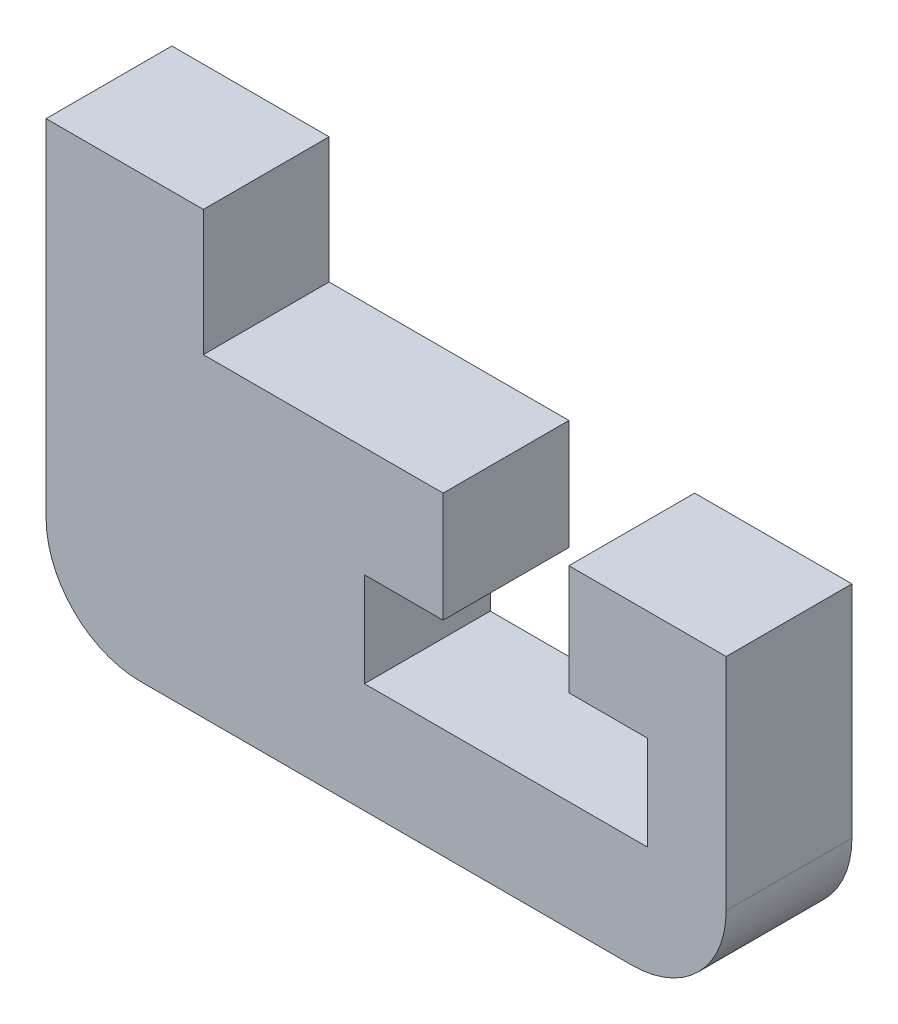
ISO-10303-21;
HEADER;
FILE_DESCRIPTION(('STEP AP214'),'2;1');
FILE_NAME('part.step','',(''),(''),'','','');
FILE_SCHEMA(('AUTOMOTIVE_DESIGN { 1 0 10303 214 1 1 1 1 }'));
ENDSEC;
DATA;
#1=APPLICATION_CONTEXT('core data for automotive mechanical design processes');
#2=APPLICATION_PROTOCOL_DEFINITION('international standard','automotive_design',2000,#1);
#3=PRODUCT_CONTEXT('',#1,'mechanical');
#4=PRODUCT('Part','Part','',(#3));
#5=PRODUCT_RELATED_PRODUCT_CATEGORY('part','',(#4));
#6=PRODUCT_DEFINITION_FORMATION('','',#4);
#7=PRODUCT_DEFINITION_CONTEXT('part definition',#1,'design');
#8=PRODUCT_DEFINITION('design','',#6,#7);
#9=PRODUCT_DEFINITION_SHAPE('','',#8);
#10=(LENGTH_UNIT() NAMED_UNIT(*) SI_UNIT(.MILLI.,.METRE.));
#11=(NAMED_UNIT(*) PLANE_ANGLE_UNIT() SI_UNIT($,.RADIAN.));
#12=(NAMED_UNIT(*) SI_UNIT($,.STERADIAN.) SOLID_ANGLE_UNIT());
#13=UNCERTAINTY_MEASURE_WITH_UNIT(LENGTH_MEASURE(1.E-05),#10,'distance_accuracy_value','');
#14=(GEOMETRIC_REPRESENTATION_CONTEXT(3) GLOBAL_UNCERTAINTY_ASSIGNED_CONTEXT((#13)) GLOBAL_UNIT_ASSIGNED_CONTEXT((#10,
#11,#12)) REPRESENTATION_CONTEXT('',''));
#15=CARTESIAN_POINT('',(0.,0.,0.));
#16=DIRECTION('',(0.,0.,1.));
#17=DIRECTION('',(1.,0.,0.));
#18=AXIS2_PLACEMENT_3D('',#15,#16,#17);
#19=CARTESIAN_POINT('',(-2.,12.0010272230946,4.));
#20=DIRECTION('',(0.,0.,-1.));
#21=DIRECTION('',(-1.,0.,0.));
#22=AXIS2_PLACEMENT_3D('',#19,#20,#21);
#23=CYLINDRICAL_SURFACE('',#22,3.);
#24=CARTESIAN_POINT('',(-2.,12.0010272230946,0.));
#25=DIRECTION('',(0.,0.,1.));
#26=DIRECTION('',(1.,0.,0.));
#27=AXIS2_PLACEMENT_3D('',#24,#25,#26);
#28=CIRCLE('',#27,3.);
#29=CARTESIAN_POINT('',(-5.,12.0010272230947,0.));
#30=VERTEX_POINT('',#29);
#31=CARTESIAN_POINT('',(-1.99999999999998,9.00102722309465,0.));
#32=VERTEX_POINT('',#31);
#33=EDGE_CURVE('E179',#30,#32,#28,.T.);
#34=ORIENTED_EDGE('',*,*,#33,.T.);
#35=DIRECTION('',(0.,0.,-1.));
#36=VECTOR('',#35,1.);
#37=CARTESIAN_POINT('',(-1.99999999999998,9.00102722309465,4.));
#38=LINE('',#37,#36);
#39=CARTESIAN_POINT('',(-1.99999999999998,9.00102722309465,4.));
#40=VERTEX_POINT('',#39);
#41=EDGE_CURVE('E11',#40,#32,#38,.T.);
#42=ORIENTED_EDGE('',*,*,#41,.F.);
#43=CARTESIAN_POINT('',(-2.,12.0010272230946,4.));
#44=DIRECTION('',(0.,0.,1.));
#45=DIRECTION('',(1.,0.,0.));
#46=AXIS2_PLACEMENT_3D('',#43,#44,#45);
#47=CIRCLE('',#46,3.);
#48=CARTESIAN_POINT('',(-5.,12.0010272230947,4.));
#49=VERTEX_POINT('',#48);
#50=EDGE_CURVE('E209',#49,#40,#47,.T.);
#51=ORIENTED_EDGE('',*,*,#50,.F.);
#52=DIRECTION('',(0.,0.,-1.));
#53=VECTOR('',#52,1.);
#54=CARTESIAN_POINT('',(-5.,12.0010272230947,4.));
#55=LINE('',#54,#53);
#56=EDGE_CURVE('E175',#49,#30,#55,.T.);
#57=ORIENTED_EDGE('',*,*,#56,.T.);
#58=EDGE_LOOP('',(#34,#42,#51,#57));
#59=FACE_BOUND('',#58,.T.);
#60=ADVANCED_FACE('F35',(#59),#23,.T.);
#61=CARTESIAN_POINT('',(13.625,9.00102722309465,4.));
#62=DIRECTION('',(0.,1.,0.));
#63=DIRECTION('',(0.,0.,1.));
#64=AXIS2_PLACEMENT_3D('',#61,#62,#63);
#65=PLANE('',#64);
#66=DIRECTION('',(1.,0.,0.));
#67=VECTOR('',#66,1.);
#68=CARTESIAN_POINT('',(13.625,9.00102722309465,0.));
#69=LINE('',#68,#67);
#70=CARTESIAN_POINT('',(13.625,9.00102722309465,0.));
#71=VERTEX_POINT('',#70);
#72=EDGE_CURVE('E182',#32,#71,#69,.T.);
#73=ORIENTED_EDGE('',*,*,#72,.T.);
#74=DIRECTION('',(0.,0.,-1.));
#75=VECTOR('',#74,1.);
#76=CARTESIAN_POINT('',(13.625,9.00102722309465,4.));
#77=LINE('',#76,#75);
#78=CARTESIAN_POINT('',(13.625,9.00102722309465,4.));
#79=VERTEX_POINT('',#78);
#80=EDGE_CURVE('E43',#79,#71,#77,.T.);
#81=ORIENTED_EDGE('',*,*,#80,.F.);
#82=DIRECTION('',(1.,0.,0.));
#83=VECTOR('',#82,1.);
#84=CARTESIAN_POINT('',(13.625,9.00102722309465,4.));
#85=LINE('',#84,#83);
#86=EDGE_CURVE('E118',#40,#79,#85,.T.);
#87=ORIENTED_EDGE('',*,*,#86,.F.);
#88=ORIENTED_EDGE('',*,*,#41,.T.);
#89=EDGE_LOOP('',(#73,#81,#87,#88));
#90=FACE_BOUND('',#89,.T.);
#91=ADVANCED_FACE('F307',(#90),#65,.F.);
#92=CARTESIAN_POINT('',(13.625,12.0010272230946,4.));
#93=DIRECTION('',(0.,0.,-1.));
#94=DIRECTION('',(-1.,0.,0.));
#95=AXIS2_PLACEMENT_3D('',#92,#93,#94);
#96=CYLINDRICAL_SURFACE('',#95,3.);
#97=CARTESIAN_POINT('',(13.625,12.0010272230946,0.));
#98=DIRECTION('',(0.,0.,1.));
#99=DIRECTION('',(-1.,0.,0.));
#100=AXIS2_PLACEMENT_3D('',#97,#98,#99);
#101=CIRCLE('',#100,3.);
#102=CARTESIAN_POINT('',(16.625,12.0010272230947,0.));
#103=VERTEX_POINT('',#102);
#104=EDGE_CURVE('E184',#71,#103,#101,.T.);
#105=ORIENTED_EDGE('',*,*,#104,.T.);
#106=DIRECTION('',(0.,0.,-1.));
#107=VECTOR('',#106,1.);
#108=CARTESIAN_POINT('',(16.625,12.0010272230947,4.));
#109=LINE('',#108,#107);
#110=CARTESIAN_POINT('',(16.625,12.0010272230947,4.));
#111=VERTEX_POINT('',#110);
#112=EDGE_CURVE('E240',#111,#103,#109,.T.);
#113=ORIENTED_EDGE('',*,*,#112,.F.);
#114=CARTESIAN_POINT('',(13.625,12.0010272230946,4.));
#115=DIRECTION('',(0.,0.,1.));
#116=DIRECTION('',(-1.,0.,0.));
#117=AXIS2_PLACEMENT_3D('',#114,#115,#116);
#118=CIRCLE('',#117,3.);
#119=EDGE_CURVE('E248',#79,#111,#118,.T.);
#120=ORIENTED_EDGE('',*,*,#119,.F.);
#121=ORIENTED_EDGE('',*,*,#80,.T.);
#122=EDGE_LOOP('',(#105,#113,#120,#121));
#123=FACE_BOUND('',#122,.T.);
#124=ADVANCED_FACE('F246',(#123),#96,.T.);
#125=CARTESIAN_POINT('',(16.625,19.0010272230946,4.));
#126=DIRECTION('',(-1.,0.,0.));
#127=DIRECTION('',(0.,0.,1.));
#128=AXIS2_PLACEMENT_3D('',#125,#126,#127);
#129=PLANE('',#128);
#130=DIRECTION('',(0.,1.,0.));
#131=VECTOR('',#130,1.);
#132=CARTESIAN_POINT('',(16.625,19.0010272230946,0.));
#133=LINE('',#132,#131);
#134=CARTESIAN_POINT('',(16.625,19.0010272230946,0.));
#135=VERTEX_POINT('',#134);
#136=EDGE_CURVE('E186',#103,#135,#133,.T.);
#137=ORIENTED_EDGE('',*,*,#136,.T.);
#138=DIRECTION('',(0.,0.,-1.));
#139=VECTOR('',#138,1.);
#140=CARTESIAN_POINT('',(16.625,19.0010272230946,4.));
#141=LINE('',#140,#139);
#142=CARTESIAN_POINT('',(16.625,19.0010272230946,4.));
#143=VERTEX_POINT('',#142);
#144=EDGE_CURVE('E237',#143,#135,#141,.T.);
#145=ORIENTED_EDGE('',*,*,#144,.F.);
#146=DIRECTION('',(0.,1.,0.));
#147=VECTOR('',#146,1.);
#148=CARTESIAN_POINT('',(16.625,19.0010272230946,4.));
#149=LINE('',#148,#147);
#150=EDGE_CURVE('E266',#111,#143,#149,.T.);
#151=ORIENTED_EDGE('',*,*,#150,.F.);
#152=ORIENTED_EDGE('',*,*,#112,.T.);
#153=EDGE_LOOP('',(#137,#145,#151,#152));
#154=FACE_BOUND('',#153,.T.);
#155=ADVANCED_FACE('F257',(#154),#129,.F.);
#156=CARTESIAN_POINT('',(11.625,19.0010272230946,4.));
#157=DIRECTION('',(0.,-1.,0.));
#158=DIRECTION('',(0.,0.,-1.));
#159=AXIS2_PLACEMENT_3D('',#156,#157,#158);
#160=PLANE('',#159);
#161=DIRECTION('',(-1.,0.,0.));
#162=VECTOR('',#161,1.);
#163=CARTESIAN_POINT('',(11.625,19.0010272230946,0.));
#164=LINE('',#163,#162);
#165=CARTESIAN_POINT('',(11.625,19.0010272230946,0.));
#166=VERTEX_POINT('',#165);
#167=EDGE_CURVE('E188',#135,#166,#164,.T.);
#168=ORIENTED_EDGE('',*,*,#167,.T.);
#169=DIRECTION('',(0.,0.,-1.));
#170=VECTOR('',#169,1.);
#171=CARTESIAN_POINT('',(11.625,19.0010272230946,4.));
#172=LINE('',#171,#170);
#173=CARTESIAN_POINT('',(11.625,19.0010272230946,4.));
#174=VERTEX_POINT('',#173);
#175=EDGE_CURVE('E234',#174,#166,#172,.T.);
#176=ORIENTED_EDGE('',*,*,#175,.F.);
#177=DIRECTION('',(-1.,0.,0.));
#178=VECTOR('',#177,1.);
#179=CARTESIAN_POINT('',(11.625,19.0010272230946,4.));
#180=LINE('',#179,#178);
#181=EDGE_CURVE('E263',#143,#174,#180,.T.);
#182=ORIENTED_EDGE('',*,*,#181,.F.);
#183=ORIENTED_EDGE('',*,*,#144,.T.);
#184=EDGE_LOOP('',(#168,#176,#182,#183));
#185=FACE_BOUND('',#184,.T.);
#186=ADVANCED_FACE('F261',(#185),#160,.F.);
#187=CARTESIAN_POINT('',(11.625,19.0010272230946,4.));
#188=DIRECTION('',(1.,0.,0.));
#189=DIRECTION('',(0.,0.,-1.));
#190=AXIS2_PLACEMENT_3D('',#187,#188,#189);
#191=PLANE('',#190);
#192=DIRECTION('',(0.,-1.,0.));
#193=VECTOR('',#192,1.);
#194=CARTESIAN_POINT('',(11.625,19.0010272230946,0.));
#195=LINE('',#194,#193);
#196=CARTESIAN_POINT('',(11.625,15.5010272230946,0.));
#197=VERTEX_POINT('',#196);
#198=EDGE_CURVE('E190',#166,#197,#195,.T.);
#199=ORIENTED_EDGE('',*,*,#198,.T.);
#200=DIRECTION('',(0.,0.,-1.));
#201=VECTOR('',#200,1.);
#202=CARTESIAN_POINT('',(11.625,15.5010272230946,4.));
#203=LINE('',#202,#201);
#204=CARTESIAN_POINT('',(11.625,15.5010272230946,4.));
#205=VERTEX_POINT('',#204);
#206=EDGE_CURVE('E231',#205,#197,#203,.T.);
#207=ORIENTED_EDGE('',*,*,#206,.F.);
#208=DIRECTION('',(0.,-1.,0.));
#209=VECTOR('',#208,1.);
#210=CARTESIAN_POINT('',(11.625,19.0010272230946,4.));
#211=LINE('',#210,#209);
#212=EDGE_CURVE('E265',#174,#205,#211,.T.);
#213=ORIENTED_EDGE('',*,*,#212,.F.);
#214=ORIENTED_EDGE('',*,*,#175,.T.);
#215=EDGE_LOOP('',(#199,#207,#213,#214));
#216=FACE_BOUND('',#215,.T.);
#217=ADVANCED_FACE('F320',(#216),#191,.F.);
#218=CARTESIAN_POINT('',(11.625,15.5010272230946,4.));
#219=DIRECTION('',(0.,1.,0.));
#220=DIRECTION('',(0.,0.,1.));
#221=AXIS2_PLACEMENT_3D('',#218,#219,#220);
#222=PLANE('',#221);
#223=DIRECTION('',(1.,0.,0.));
#224=VECTOR('',#223,1.);
#225=CARTESIAN_POINT('',(11.625,15.5010272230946,0.));
#226=LINE('',#225,#224);
#227=CARTESIAN_POINT('',(14.125,15.5010272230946,0.));
#228=VERTEX_POINT('',#227);
#229=EDGE_CURVE('E192',#197,#228,#226,.T.);
#230=ORIENTED_EDGE('',*,*,#229,.T.);
#231=DIRECTION('',(0.,0.,-1.));
#232=VECTOR('',#231,1.);
#233=CARTESIAN_POINT('',(14.125,15.5010272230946,4.));
#234=LINE('',#233,#232);
#235=CARTESIAN_POINT('',(14.125,15.5010272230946,4.));
#236=VERTEX_POINT('',#235);
#237=EDGE_CURVE('E228',#236,#228,#234,.T.);
#238=ORIENTED_EDGE('',*,*,#237,.F.);
#239=DIRECTION('',(1.,0.,0.));
#240=VECTOR('',#239,1.);
#241=CARTESIAN_POINT('',(11.625,15.5010272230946,4.));
#242=LINE('',#241,#240);
#243=EDGE_CURVE('E268',#205,#236,#242,.T.);
#244=ORIENTED_EDGE('',*,*,#243,.F.);
#245=ORIENTED_EDGE('',*,*,#206,.T.);
#246=EDGE_LOOP('',(#230,#238,#244,#245));
#247=FACE_BOUND('',#246,.T.);
#248=ADVANCED_FACE('F323',(#247),#222,.F.);
#249=CARTESIAN_POINT('',(14.125,15.5010272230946,4.));
#250=DIRECTION('',(1.,0.,0.));
#251=DIRECTION('',(0.,0.,-1.));
#252=AXIS2_PLACEMENT_3D('',#249,#250,#251);
#253=PLANE('',#252);
#254=DIRECTION('',(0.,-1.,0.));
#255=VECTOR('',#254,1.);
#256=CARTESIAN_POINT('',(14.125,15.5010272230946,0.));
#257=LINE('',#256,#255);
#258=CARTESIAN_POINT('',(14.125,12.5010272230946,0.));
#259=VERTEX_POINT('',#258);
#260=EDGE_CURVE('E194',#228,#259,#257,.T.);
#261=ORIENTED_EDGE('',*,*,#260,.T.);
#262=DIRECTION('',(0.,0.,-1.));
#263=VECTOR('',#262,1.);
#264=CARTESIAN_POINT('',(14.125,12.5010272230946,4.));
#265=LINE('',#264,#263);
#266=CARTESIAN_POINT('',(14.125,12.5010272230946,4.));
#267=VERTEX_POINT('',#266);
#268=EDGE_CURVE('E225',#267,#259,#265,.T.);
#269=ORIENTED_EDGE('',*,*,#268,.F.);
#270=DIRECTION('',(0.,-1.,0.));
#271=VECTOR('',#270,1.);
#272=CARTESIAN_POINT('',(14.125,15.5010272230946,4.));
#273=LINE('',#272,#271);
#274=EDGE_CURVE('E274',#236,#267,#273,.T.);
#275=ORIENTED_EDGE('',*,*,#274,.F.);
#276=ORIENTED_EDGE('',*,*,#237,.T.);
#277=EDGE_LOOP('',(#261,#269,#275,#276));
#278=FACE_BOUND('',#277,.T.);
#279=ADVANCED_FACE('F327',(#278),#253,.F.);
#280=CARTESIAN_POINT('',(14.125,12.5010272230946,4.));
#281=DIRECTION('',(0.,-1.,0.));
#282=DIRECTION('',(1.,0.,0.));
#283=AXIS2_PLACEMENT_3D('',#280,#281,#282);
#284=PLANE('',#283);
#285=DIRECTION('',(-1.,0.,0.));
#286=VECTOR('',#285,1.);
#287=CARTESIAN_POINT('',(14.125,12.5010272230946,0.));
#288=LINE('',#287,#286);
#289=CARTESIAN_POINT('',(5.125,12.5010272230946,0.));
#290=VERTEX_POINT('',#289);
#291=EDGE_CURVE('E196',#259,#290,#288,.T.);
#292=ORIENTED_EDGE('',*,*,#291,.T.);
#293=DIRECTION('',(0.,0.,-1.));
#294=VECTOR('',#293,1.);
#295=CARTESIAN_POINT('',(5.125,12.5010272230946,4.));
#296=LINE('',#295,#294);
#297=CARTESIAN_POINT('',(5.125,12.5010272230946,4.));
#298=VERTEX_POINT('',#297);
#299=EDGE_CURVE('E222',#298,#290,#296,.T.);
#300=ORIENTED_EDGE('',*,*,#299,.F.);
#301=DIRECTION('',(-1.,0.,0.));
#302=VECTOR('',#301,1.);
#303=CARTESIAN_POINT('',(14.125,12.5010272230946,4.));
#304=LINE('',#303,#302);
#305=EDGE_CURVE('E276',#267,#298,#304,.T.);
#306=ORIENTED_EDGE('',*,*,#305,.F.);
#307=ORIENTED_EDGE('',*,*,#268,.T.);
#308=EDGE_LOOP('',(#292,#300,#306,#307));
#309=FACE_BOUND('',#308,.T.);
#310=ADVANCED_FACE('F331',(#309),#284,.F.);
#311=CARTESIAN_POINT('',(5.125,12.5010272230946,4.));
#312=DIRECTION('',(-1.,0.,0.));
#313=DIRECTION('',(0.,0.,1.));
#314=AXIS2_PLACEMENT_3D('',#311,#312,#313);
#315=PLANE('',#314);
#316=DIRECTION('',(0.,1.,0.));
#317=VECTOR('',#316,1.);
#318=CARTESIAN_POINT('',(5.125,12.5010272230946,0.));
#319=LINE('',#318,#317);
#320=CARTESIAN_POINT('',(5.125,15.5010272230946,0.));
#321=VERTEX_POINT('',#320);
#322=EDGE_CURVE('E198',#290,#321,#319,.T.);
#323=ORIENTED_EDGE('',*,*,#322,.T.);
#324=DIRECTION('',(0.,0.,-1.));
#325=VECTOR('',#324,1.);
#326=CARTESIAN_POINT('',(5.125,15.5010272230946,4.));
#327=LINE('',#326,#325);
#328=CARTESIAN_POINT('',(5.125,15.5010272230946,4.));
#329=VERTEX_POINT('',#328);
#330=EDGE_CURVE('E219',#329,#321,#327,.T.);
#331=ORIENTED_EDGE('',*,*,#330,.F.);
#332=DIRECTION('',(0.,1.,0.));
#333=VECTOR('',#332,1.);
#334=CARTESIAN_POINT('',(5.125,12.5010272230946,4.));
#335=LINE('',#334,#333);
#336=EDGE_CURVE('E278',#298,#329,#335,.T.);
#337=ORIENTED_EDGE('',*,*,#336,.F.);
#338=ORIENTED_EDGE('',*,*,#299,.T.);
#339=EDGE_LOOP('',(#323,#331,#337,#338));
#340=FACE_BOUND('',#339,.T.);
#341=ADVANCED_FACE('F335',(#340),#315,.F.);
#342=CARTESIAN_POINT('',(5.125,15.5010272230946,4.));
#343=DIRECTION('',(0.,1.,0.));
#344=DIRECTION('',(0.,0.,1.));
#345=AXIS2_PLACEMENT_3D('',#342,#343,#344);
#346=PLANE('',#345);
#347=DIRECTION('',(1.,0.,0.));
#348=VECTOR('',#347,1.);
#349=CARTESIAN_POINT('',(5.125,15.5010272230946,0.));
#350=LINE('',#349,#348);
#351=CARTESIAN_POINT('',(7.625,15.5010272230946,0.));
#352=VERTEX_POINT('',#351);
#353=EDGE_CURVE('E200',#321,#352,#350,.T.);
#354=ORIENTED_EDGE('',*,*,#353,.T.);
#355=DIRECTION('',(0.,0.,-1.));
#356=VECTOR('',#355,1.);
#357=CARTESIAN_POINT('',(7.625,15.5010272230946,4.));
#358=LINE('',#357,#356);
#359=CARTESIAN_POINT('',(7.625,15.5010272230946,4.));
#360=VERTEX_POINT('',#359);
#361=EDGE_CURVE('E216',#360,#352,#358,.T.);
#362=ORIENTED_EDGE('',*,*,#361,.F.);
#363=DIRECTION('',(1.,0.,0.));
#364=VECTOR('',#363,1.);
#365=CARTESIAN_POINT('',(5.125,15.5010272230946,4.));
#366=LINE('',#365,#364);
#367=EDGE_CURVE('E280',#329,#360,#366,.T.);
#368=ORIENTED_EDGE('',*,*,#367,.F.);
#369=ORIENTED_EDGE('',*,*,#330,.T.);
#370=EDGE_LOOP('',(#354,#362,#368,#369));
#371=FACE_BOUND('',#370,.T.);
#372=ADVANCED_FACE('F339',(#371),#346,.F.);
#373=CARTESIAN_POINT('',(7.625,15.5010272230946,4.));
#374=DIRECTION('',(-1.,0.,0.));
#375=DIRECTION('',(0.,0.,1.));
#376=AXIS2_PLACEMENT_3D('',#373,#374,#375);
#377=PLANE('',#376);
#378=DIRECTION('',(0.,1.,0.));
#379=VECTOR('',#378,1.);
#380=CARTESIAN_POINT('',(7.625,15.5010272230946,0.));
#381=LINE('',#380,#379);
#382=CARTESIAN_POINT('',(7.625,19.0010272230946,0.));
#383=VERTEX_POINT('',#382);
#384=EDGE_CURVE('E202',#352,#383,#381,.T.);
#385=ORIENTED_EDGE('',*,*,#384,.T.);
#386=DIRECTION('',(0.,0.,-1.));
#387=VECTOR('',#386,1.);
#388=CARTESIAN_POINT('',(7.625,19.0010272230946,4.));
#389=LINE('',#388,#387);
#390=CARTESIAN_POINT('',(7.625,19.0010272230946,4.));
#391=VERTEX_POINT('',#390);
#392=EDGE_CURVE('E213',#391,#383,#389,.T.);
#393=ORIENTED_EDGE('',*,*,#392,.F.);
#394=DIRECTION('',(0.,1.,0.));
#395=VECTOR('',#394,1.);
#396=CARTESIAN_POINT('',(7.625,15.5010272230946,4.));
#397=LINE('',#396,#395);
#398=EDGE_CURVE('E282',#360,#391,#397,.T.);
#399=ORIENTED_EDGE('',*,*,#398,.F.);
#400=ORIENTED_EDGE('',*,*,#361,.T.);
#401=EDGE_LOOP('',(#385,#393,#399,#400));
#402=FACE_BOUND('',#401,.T.);
#403=ADVANCED_FACE('F288',(#402),#377,.F.);
#404=CARTESIAN_POINT('',(7.625,19.0010272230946,4.));
#405=DIRECTION('',(0.,-1.,0.));
#406=DIRECTION('',(0.,0.,-1.));
#407=AXIS2_PLACEMENT_3D('',#404,#405,#406);
#408=PLANE('',#407);
#409=DIRECTION('',(-1.,0.,0.));
#410=VECTOR('',#409,1.);
#411=CARTESIAN_POINT('',(7.625,19.0010272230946,0.));
#412=LINE('',#411,#410);
#413=CARTESIAN_POINT('',(0.,19.0010272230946,0.));
#414=VERTEX_POINT('',#413);
#415=EDGE_CURVE('E204',#383,#414,#412,.T.);
#416=ORIENTED_EDGE('',*,*,#415,.T.);
#417=DIRECTION('',(0.,0.,-1.));
#418=VECTOR('',#417,1.);
#419=CARTESIAN_POINT('',(0.,19.0010272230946,4.));
#420=LINE('',#419,#418);
#421=CARTESIAN_POINT('',(0.,19.0010272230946,4.));
#422=VERTEX_POINT('',#421);
#423=EDGE_CURVE('E170',#422,#414,#420,.T.);
#424=ORIENTED_EDGE('',*,*,#423,.F.);
#425=DIRECTION('',(-1.,0.,0.));
#426=VECTOR('',#425,1.);
#427=CARTESIAN_POINT('',(7.625,19.0010272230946,4.));
#428=LINE('',#427,#426);
#429=EDGE_CURVE('E161',#391,#422,#428,.T.);
#430=ORIENTED_EDGE('',*,*,#429,.F.);
#431=ORIENTED_EDGE('',*,*,#392,.T.);
#432=EDGE_LOOP('',(#416,#424,#430,#431));
#433=FACE_BOUND('',#432,.T.);
#434=ADVANCED_FACE('F292',(#433),#408,.F.);
#435=CARTESIAN_POINT('',(0.,19.0010272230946,4.));
#436=DIRECTION('',(-1.,0.,0.));
#437=DIRECTION('',(0.,0.,1.));
#438=AXIS2_PLACEMENT_3D('',#435,#436,#437);
#439=PLANE('',#438);
#440=DIRECTION('',(0.,1.,0.));
#441=VECTOR('',#440,1.);
#442=CARTESIAN_POINT('',(0.,19.0010272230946,0.));
#443=LINE('',#442,#441);
#444=CARTESIAN_POINT('',(0.,23.0010272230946,0.));
#445=VERTEX_POINT('',#444);
#446=EDGE_CURVE('E169',#414,#445,#443,.T.);
#447=ORIENTED_EDGE('',*,*,#446,.T.);
#448=DIRECTION('',(0.,0.,-1.));
#449=VECTOR('',#448,1.);
#450=CARTESIAN_POINT('',(0.,23.0010272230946,4.));
#451=LINE('',#450,#449);
#452=CARTESIAN_POINT('',(0.,23.0010272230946,4.));
#453=VERTEX_POINT('',#452);
#454=EDGE_CURVE('E166',#453,#445,#451,.T.);
#455=ORIENTED_EDGE('',*,*,#454,.F.);
#456=DIRECTION('',(0.,1.,0.));
#457=VECTOR('',#456,1.);
#458=CARTESIAN_POINT('',(0.,19.0010272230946,4.));
#459=LINE('',#458,#457);
#460=EDGE_CURVE('E155',#422,#453,#459,.T.);
#461=ORIENTED_EDGE('',*,*,#460,.F.);
#462=ORIENTED_EDGE('',*,*,#423,.T.);
#463=EDGE_LOOP('',(#447,#455,#461,#462));
#464=FACE_BOUND('',#463,.T.);
#465=ADVANCED_FACE('F167',(#464),#439,.F.);
#466=CARTESIAN_POINT('',(0.,23.0010272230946,4.));
#467=DIRECTION('',(0.,-1.,0.));
#468=DIRECTION('',(0.,0.,-1.));
#469=AXIS2_PLACEMENT_3D('',#466,#467,#468);
#470=PLANE('',#469);
#471=DIRECTION('',(-1.,0.,0.));
#472=VECTOR('',#471,1.);
#473=CARTESIAN_POINT('',(0.,23.0010272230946,0.));
#474=LINE('',#473,#472);
#475=CARTESIAN_POINT('',(-5.,23.0010272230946,0.));
#476=VERTEX_POINT('',#475);
#477=EDGE_CURVE('E104',#445,#476,#474,.T.);
#478=ORIENTED_EDGE('',*,*,#477,.T.);
#479=DIRECTION('',(0.,0.,-1.));
#480=VECTOR('',#479,1.);
#481=CARTESIAN_POINT('',(-5.,23.0010272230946,4.));
#482=LINE('',#481,#480);
#483=CARTESIAN_POINT('',(-5.,23.0010272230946,4.));
#484=VERTEX_POINT('',#483);
#485=EDGE_CURVE('E171',#484,#476,#482,.T.);
#486=ORIENTED_EDGE('',*,*,#485,.F.);
#487=DIRECTION('',(-1.,0.,0.));
#488=VECTOR('',#487,1.);
#489=CARTESIAN_POINT('',(0.,23.0010272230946,4.));
#490=LINE('',#489,#488);
#491=EDGE_CURVE('E159',#453,#484,#490,.T.);
#492=ORIENTED_EDGE('',*,*,#491,.F.);
#493=ORIENTED_EDGE('',*,*,#454,.T.);
#494=EDGE_LOOP('',(#478,#486,#492,#493));
#495=FACE_BOUND('',#494,.T.);
#496=ADVANCED_FACE('F173',(#495),#470,.F.);
#497=CARTESIAN_POINT('',(-5.,23.0010272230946,4.));
#498=DIRECTION('',(1.,0.,0.));
#499=DIRECTION('',(0.,1.,0.));
#500=AXIS2_PLACEMENT_3D('',#497,#498,#499);
#501=PLANE('',#500);
#502=DIRECTION('',(0.,-1.,0.));
#503=VECTOR('',#502,1.);
#504=CARTESIAN_POINT('',(-5.,23.0010272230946,0.));
#505=LINE('',#504,#503);
#506=EDGE_CURVE('E110',#476,#30,#505,.T.);
#507=ORIENTED_EDGE('',*,*,#506,.T.);
#508=ORIENTED_EDGE('',*,*,#56,.F.);
#509=DIRECTION('',(0.,-1.,0.));
#510=VECTOR('',#509,1.);
#511=CARTESIAN_POINT('',(-5.,23.0010272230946,4.));
#512=LINE('',#511,#510);
#513=EDGE_CURVE('E51',#484,#49,#512,.T.);
#514=ORIENTED_EDGE('',*,*,#513,.F.);
#515=ORIENTED_EDGE('',*,*,#485,.T.);
#516=EDGE_LOOP('',(#507,#508,#514,#515));
#517=FACE_BOUND('',#516,.T.);
#518=ADVANCED_FACE('F296',(#517),#501,.F.);
#519=CARTESIAN_POINT('',(-2.,12.0010272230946,4.));
#520=DIRECTION('',(0.,0.,1.));
#521=DIRECTION('',(1.,0.,0.));
#522=AXIS2_PLACEMENT_3D('',#519,#520,#521);
#523=PLANE('',#522);
#524=ORIENTED_EDGE('',*,*,#50,.T.);
#525=ORIENTED_EDGE('',*,*,#86,.T.);
#526=ORIENTED_EDGE('',*,*,#119,.T.);
#527=ORIENTED_EDGE('',*,*,#150,.T.);
#528=ORIENTED_EDGE('',*,*,#181,.T.);
#529=ORIENTED_EDGE('',*,*,#212,.T.);
#530=ORIENTED_EDGE('',*,*,#243,.T.);
#531=ORIENTED_EDGE('',*,*,#274,.T.);
#532=ORIENTED_EDGE('',*,*,#305,.T.);
#533=ORIENTED_EDGE('',*,*,#336,.T.);
#534=ORIENTED_EDGE('',*,*,#367,.T.);
#535=ORIENTED_EDGE('',*,*,#398,.T.);
#536=ORIENTED_EDGE('',*,*,#429,.T.);
#537=ORIENTED_EDGE('',*,*,#460,.T.);
#538=ORIENTED_EDGE('',*,*,#491,.T.);
#539=ORIENTED_EDGE('',*,*,#513,.T.);
#540=EDGE_LOOP('',(#524,#525,#526,#527,#528,#529,#530,#531,#532,#533,#534,#535,#536,#537,#538,#539));
#541=FACE_BOUND('',#540,.T.);
#542=ADVANCED_FACE('F157',(#541),#523,.T.);
#543=CARTESIAN_POINT('',(-2.,12.0010272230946,0.));
#544=DIRECTION('',(0.,0.,1.));
#545=DIRECTION('',(1.,0.,0.));
#546=AXIS2_PLACEMENT_3D('',#543,#544,#545);
#547=PLANE('',#546);
#548=ORIENTED_EDGE('',*,*,#33,.F.);
#549=ORIENTED_EDGE('',*,*,#506,.F.);
#550=ORIENTED_EDGE('',*,*,#477,.F.);
#551=ORIENTED_EDGE('',*,*,#446,.F.);
#552=ORIENTED_EDGE('',*,*,#415,.F.);
#553=ORIENTED_EDGE('',*,*,#384,.F.);
#554=ORIENTED_EDGE('',*,*,#353,.F.);
#555=ORIENTED_EDGE('',*,*,#322,.F.);
#556=ORIENTED_EDGE('',*,*,#291,.F.);
#557=ORIENTED_EDGE('',*,*,#260,.F.);
#558=ORIENTED_EDGE('',*,*,#229,.F.);
#559=ORIENTED_EDGE('',*,*,#198,.F.);
#560=ORIENTED_EDGE('',*,*,#167,.F.);
#561=ORIENTED_EDGE('',*,*,#136,.F.);
#562=ORIENTED_EDGE('',*,*,#104,.F.);
#563=ORIENTED_EDGE('',*,*,#72,.F.);
#564=EDGE_LOOP('',(#548,#549,#550,#551,#552,#553,#554,#555,#556,#557,#558,#559,#560,#561,#562,#563));
#565=FACE_BOUND('',#564,.T.);
#566=ADVANCED_FACE('F252',(#565),#547,.F.);
#567=CLOSED_SHELL('',(#60,#91,#124,#155,#186,#217,#248,#279,#310,#341,#372,#403,#434,#465,#496,
#518,#542,#566));
#568=MANIFOLD_SOLID_BREP('B2',#567);
#569=ADVANCED_BREP_SHAPE_REPRESENTATION('',(#18,#568),#14);
#570=SHAPE_DEFINITION_REPRESENTATION(#9,#569);
ENDSEC;
END-ISO-10303-21;
